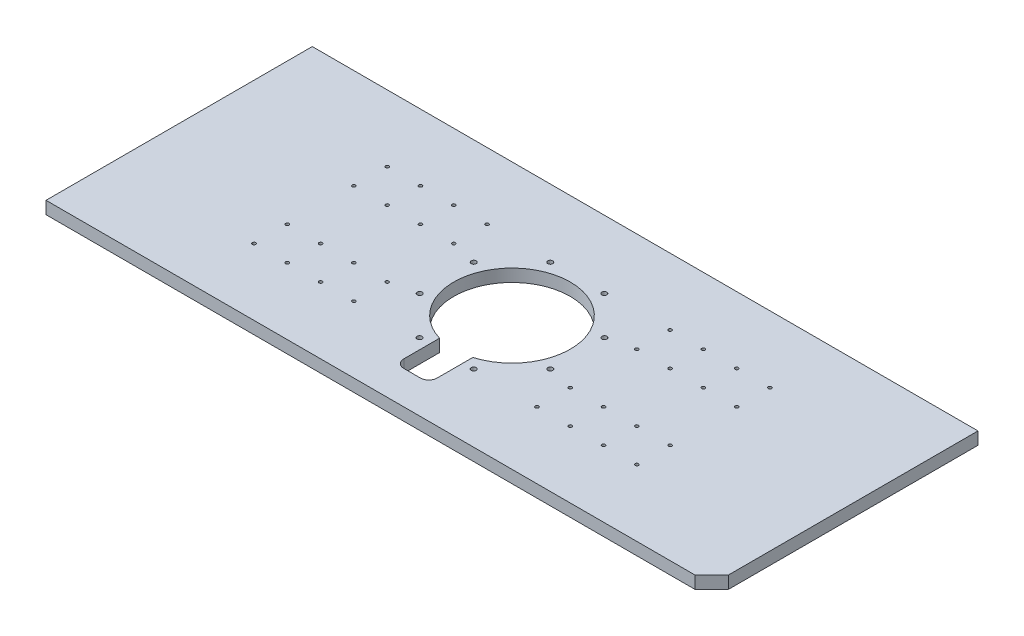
from build123d import *

# Parameters (mm, degrees)
EXTRUDE1_DEPTH        = 9.525
CUTAWAY_DEPTH         = 326.418139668
CHAMFER1_SIZE         = 12.7
F_6_CLEARANCE_HOLE1_D = 3.7973
CIRPATTERN4_COUNT     = 8
F_6_32_TAPPED_HOLE1_D = 2.54
FILLET1_R             = 6.35
LPATTERN1_COUNT       = 2
LPATTERN1_PITCH       = 50.8
MIRROR1_COPY_1_D      = 2.54


with BuildPart() as part:
    # Sketch1 → Extrude1 (new body)
    with BuildSketch(Plane(origin=(0, 0, 0), x_dir=(1, 0, 0), z_dir=(0, 1, 0))):
        Polygon((0, 0), (254, 0), (254, 203.2), (-254, 203.2), (-254, 0), align=None)
    extrude(amount=EXTRUDE1_DEPTH)

    # Sketch2 → cutaway (cut, through all)
    with BuildSketch(Plane(origin=(0, 9.525, 0), x_dir=(-1, 0, 0), z_dir=(0, 1, 0))):
        with BuildLine():
            Line((-12.7, -25.4), (-12.7, -59.002905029))
            ThreePointArc((-12.7, -59.002905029), (0, -146.05), (12.7, -59.002905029))
            Line((12.7, -59.002905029), (12.7, -25.4))
            Line((12.7, -25.4), (-12.7, -25.4))
        make_face()
    extrude(amount=-CUTAWAY_DEPTH, mode=Mode.SUBTRACT)

    # Chamfer1
    chamfer1_edges = [part.edges().sort_by_distance(p)[0] for p in [
        (254, 4.7625, 0),
    ]]
    chamfer(chamfer1_edges, length=CHAMFER1_SIZE)

    # 6 Clearance Hole1 (through all)
    with Locations(Plane(origin=(0, 9.525, 0), x_dir=(-1, 0, 0), z_dir=(0, 1, 0))):
        with Locations((-49.866397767, -80.944661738)):
            f_6_clearance_hole1 = Hole(F_6_CLEARANCE_HOLE1_D / 2)

    # CirPattern4: 6 Clearance Hole1 ×8 about axis
    cirpattern4_axis = Axis((0, 0, -101.6), (0, 1, 0))
    for i in range(1, CIRPATTERN4_COUNT):
        add(f_6_clearance_hole1.rotate(cirpattern4_axis, i * 360 / CIRPATTERN4_COUNT), mode=Mode.SUBTRACT)

    # 6-32 Tapped Hole1 (through all)
    with Locations(Plane(origin=(0, 9.525, 0), x_dir=(-1, 0, 0), z_dir=(0, 1, 0))):
        with Locations((69.85, -50.8), (95.25, -50.8), (95.25, -152.4), (69.85, -152.4), (69.85, -76.2), (95.25, -76.2), (69.85, -127), (95.25, -127)):
            f_6_32_tapped_hole1 = Hole(F_6_32_TAPPED_HOLE1_D / 2)

    # Fillet1
    fillet1_edges = [part.edges().sort_by_distance(p)[0] for p in [
        (12.7, 4.7625, -25.4),
        (-12.7, 4.7625, -25.4),
    ]]
    fillet(fillet1_edges, radius=FILLET1_R)

    # LPattern1: 6-32 Tapped Hole1 ×2
    with Locations(*[(-i * LPATTERN1_PITCH, 0, 0) for i in range(1, LPATTERN1_COUNT)]):
        add(f_6_32_tapped_hole1, mode=Mode.SUBTRACT)

    # Mirror1: 6-32 Tapped Hole1 across plane
    add(f_6_32_tapped_hole1.mirror(Plane(origin=(0, 0, 0), x_dir=(0, 0, 1), z_dir=(1, 0, 0))), mode=Mode.SUBTRACT)

    # Mirror1 copy 1 (through all)
    with Locations(Plane(origin=(50.8, 9.525, 0), x_dir=(1, 0, 0), z_dir=(0, 1, 0))):
        with Locations((69.85, 50.8), (95.25, 50.8), (95.25, 152.4), (69.85, 152.4), (69.85, 76.2), (95.25, 76.2), (69.85, 127), (95.25, 127)):
            Hole(MIRROR1_COPY_1_D / 2)


solid = part.part
